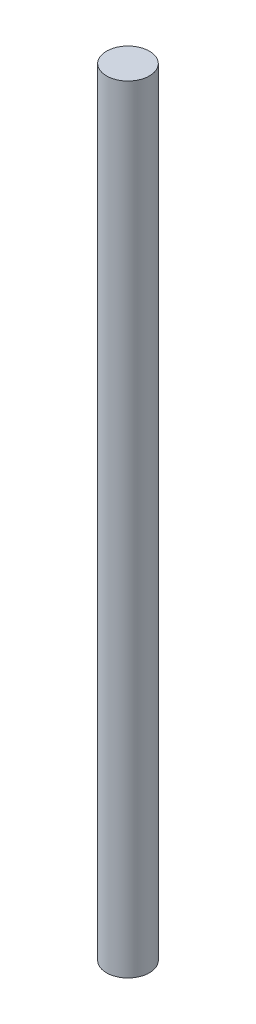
ISO-10303-21;
HEADER;
FILE_DESCRIPTION(('STEP AP214'),'2;1');
FILE_NAME('part.step','',(''),(''),'','','');
FILE_SCHEMA(('AUTOMOTIVE_DESIGN { 1 0 10303 214 1 1 1 1 }'));
ENDSEC;
DATA;
#1=APPLICATION_CONTEXT('core data for automotive mechanical design processes');
#2=APPLICATION_PROTOCOL_DEFINITION('international standard','automotive_design',2000,#1);
#3=PRODUCT_CONTEXT('',#1,'mechanical');
#4=PRODUCT('Part','Part','',(#3));
#5=PRODUCT_RELATED_PRODUCT_CATEGORY('part','',(#4));
#6=PRODUCT_DEFINITION_FORMATION('','',#4);
#7=PRODUCT_DEFINITION_CONTEXT('part definition',#1,'design');
#8=PRODUCT_DEFINITION('design','',#6,#7);
#9=PRODUCT_DEFINITION_SHAPE('','',#8);
#10=(LENGTH_UNIT() NAMED_UNIT(*) SI_UNIT(.MILLI.,.METRE.));
#11=(NAMED_UNIT(*) PLANE_ANGLE_UNIT() SI_UNIT($,.RADIAN.));
#12=(NAMED_UNIT(*) SI_UNIT($,.STERADIAN.) SOLID_ANGLE_UNIT());
#13=UNCERTAINTY_MEASURE_WITH_UNIT(LENGTH_MEASURE(1.E-05),#10,'distance_accuracy_value','');
#14=(GEOMETRIC_REPRESENTATION_CONTEXT(3) GLOBAL_UNCERTAINTY_ASSIGNED_CONTEXT((#13)) GLOBAL_UNIT_ASSIGNED_CONTEXT((#10,
#11,#12)) REPRESENTATION_CONTEXT('',''));
#15=CARTESIAN_POINT('',(0.,0.,0.));
#16=DIRECTION('',(0.,0.,1.));
#17=DIRECTION('',(1.,0.,0.));
#18=AXIS2_PLACEMENT_3D('',#15,#16,#17);
#19=CARTESIAN_POINT('',(0.,174.752,0.));
#20=DIRECTION('',(0.,-1.,0.));
#21=DIRECTION('',(0.,0.,-1.));
#22=AXIS2_PLACEMENT_3D('',#19,#20,#21);
#23=CYLINDRICAL_SURFACE('',#22,4.826);
#24=CARTESIAN_POINT('',(0.,174.752,0.));
#25=DIRECTION('',(0.,1.,0.));
#26=DIRECTION('',(0.,0.,1.));
#27=AXIS2_PLACEMENT_3D('',#24,#25,#26);
#28=CIRCLE('',#27,4.826);
#29=CARTESIAN_POINT('',(0.,174.752,4.826));
#30=VERTEX_POINT('',#29);
#31=EDGE_CURVE('E10',#30,#30,#28,.T.);
#32=ORIENTED_EDGE('',*,*,#31,.F.);
#33=EDGE_LOOP('',(#32));
#34=FACE_BOUND('',#33,.T.);
#35=CARTESIAN_POINT('',(0.,0.,0.));
#36=DIRECTION('',(0.,1.,0.));
#37=DIRECTION('',(0.,0.,1.));
#38=AXIS2_PLACEMENT_3D('',#35,#36,#37);
#39=CIRCLE('',#38,4.826);
#40=CARTESIAN_POINT('',(0.,0.,4.826));
#41=VERTEX_POINT('',#40);
#42=EDGE_CURVE('E36',#41,#41,#39,.T.);
#43=ORIENTED_EDGE('',*,*,#42,.T.);
#44=EDGE_LOOP('',(#43));
#45=FACE_BOUND('',#44,.T.);
#46=ADVANCED_FACE('F33',(#34,#45),#23,.T.);
#47=CARTESIAN_POINT('',(0.,174.752,0.));
#48=DIRECTION('',(0.,1.,0.));
#49=DIRECTION('',(0.,0.,1.));
#50=AXIS2_PLACEMENT_3D('',#47,#48,#49);
#51=PLANE('',#50);
#52=ORIENTED_EDGE('',*,*,#31,.T.);
#53=EDGE_LOOP('',(#52));
#54=FACE_BOUND('',#53,.T.);
#55=ADVANCED_FACE('F48',(#54),#51,.T.);
#56=CARTESIAN_POINT('',(0.,0.,0.));
#57=DIRECTION('',(0.,1.,0.));
#58=DIRECTION('',(0.,0.,1.));
#59=AXIS2_PLACEMENT_3D('',#56,#57,#58);
#60=PLANE('',#59);
#61=ORIENTED_EDGE('',*,*,#42,.F.);
#62=EDGE_LOOP('',(#61));
#63=FACE_BOUND('',#62,.T.);
#64=ADVANCED_FACE('F46',(#63),#60,.F.);
#65=CLOSED_SHELL('',(#46,#55,#64));
#66=MANIFOLD_SOLID_BREP('B2',#65);
#67=ADVANCED_BREP_SHAPE_REPRESENTATION('',(#18,#66),#14);
#68=SHAPE_DEFINITION_REPRESENTATION(#9,#67);
ENDSEC;
END-ISO-10303-21;
